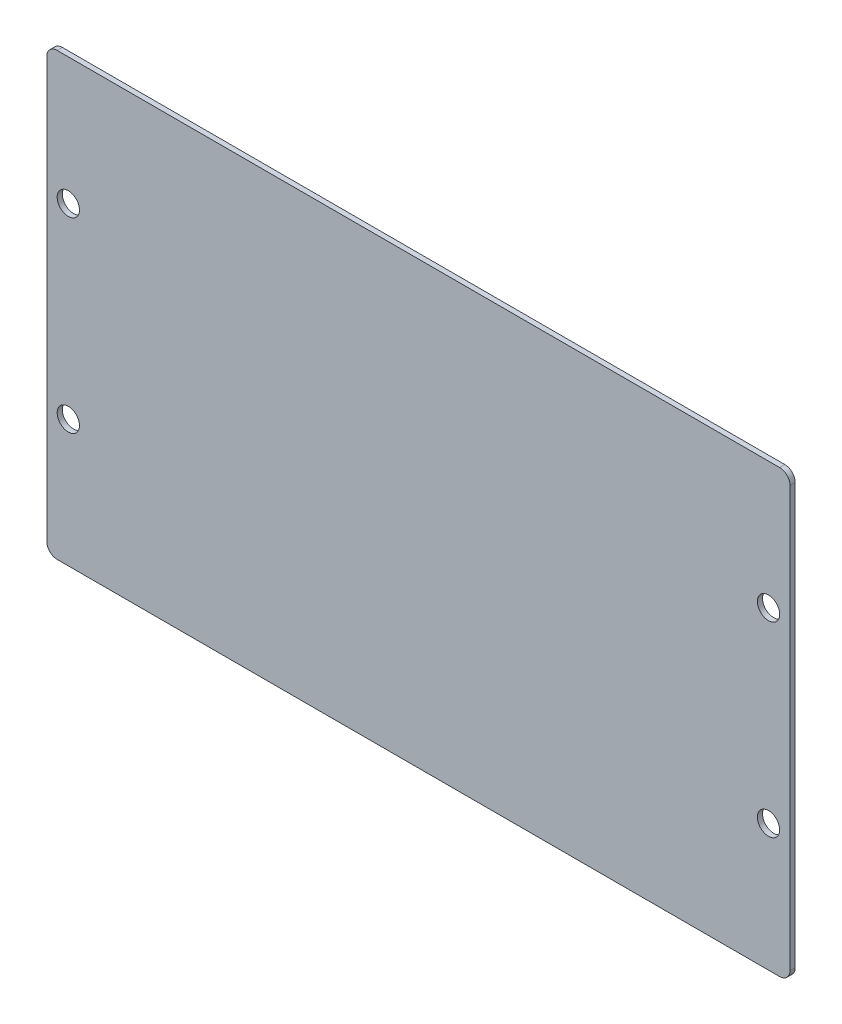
ISO-10303-21;
HEADER;
FILE_DESCRIPTION(('STEP AP214'),'2;1');
FILE_NAME('part.step','',(''),(''),'','','');
FILE_SCHEMA(('AUTOMOTIVE_DESIGN { 1 0 10303 214 1 1 1 1 }'));
ENDSEC;
DATA;
#1=APPLICATION_CONTEXT('core data for automotive mechanical design processes');
#2=APPLICATION_PROTOCOL_DEFINITION('international standard','automotive_design',2000,#1);
#3=PRODUCT_CONTEXT('',#1,'mechanical');
#4=PRODUCT('Part','Part','',(#3));
#5=PRODUCT_RELATED_PRODUCT_CATEGORY('part','',(#4));
#6=PRODUCT_DEFINITION_FORMATION('','',#4);
#7=PRODUCT_DEFINITION_CONTEXT('part definition',#1,'design');
#8=PRODUCT_DEFINITION('design','',#6,#7);
#9=PRODUCT_DEFINITION_SHAPE('','',#8);
#10=(LENGTH_UNIT() NAMED_UNIT(*) SI_UNIT(.MILLI.,.METRE.));
#11=(NAMED_UNIT(*) PLANE_ANGLE_UNIT() SI_UNIT($,.RADIAN.));
#12=(NAMED_UNIT(*) SI_UNIT($,.STERADIAN.) SOLID_ANGLE_UNIT());
#13=UNCERTAINTY_MEASURE_WITH_UNIT(LENGTH_MEASURE(1.E-05),#10,'distance_accuracy_value','');
#14=(GEOMETRIC_REPRESENTATION_CONTEXT(3) GLOBAL_UNCERTAINTY_ASSIGNED_CONTEXT((#13)) GLOBAL_UNIT_ASSIGNED_CONTEXT((#10,
#11,#12)) REPRESENTATION_CONTEXT('',''));
#15=CARTESIAN_POINT('',(0.,0.,0.));
#16=DIRECTION('',(0.,0.,1.));
#17=DIRECTION('',(1.,0.,0.));
#18=AXIS2_PLACEMENT_3D('',#15,#16,#17);
#19=CARTESIAN_POINT('',(71.65,42.5,1.));
#20=DIRECTION('',(0.,0.,1.));
#21=DIRECTION('',(0.,-1.,0.));
#22=AXIS2_PLACEMENT_3D('',#19,#20,#21);
#23=PLANE('',#22);
#24=CARTESIAN_POINT('',(-67.5,-18.,1.00000000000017));
#25=DIRECTION('',(0.,0.,-1.));
#26=DIRECTION('',(0.,1.,0.));
#27=AXIS2_PLACEMENT_3D('',#24,#25,#26);
#28=CIRCLE('',#27,2.15);
#29=CARTESIAN_POINT('',(-67.5,-15.85,1.00000000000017));
#30=VERTEX_POINT('',#29);
#31=EDGE_CURVE('E142',#30,#30,#28,.T.);
#32=ORIENTED_EDGE('',*,*,#31,.T.);
#33=EDGE_LOOP('',(#32));
#34=FACE_BOUND('',#33,.T.);
#35=CARTESIAN_POINT('',(67.5,18.,1.));
#36=DIRECTION('',(0.,0.,-1.));
#37=DIRECTION('',(0.,1.,0.));
#38=AXIS2_PLACEMENT_3D('',#35,#36,#37);
#39=CIRCLE('',#38,2.15);
#40=CARTESIAN_POINT('',(67.5,20.15,1.));
#41=VERTEX_POINT('',#40);
#42=EDGE_CURVE('E110',#41,#41,#39,.T.);
#43=ORIENTED_EDGE('',*,*,#42,.T.);
#44=EDGE_LOOP('',(#43));
#45=FACE_BOUND('',#44,.T.);
#46=DIRECTION('',(1.,0.,0.));
#47=VECTOR('',#46,1.);
#48=CARTESIAN_POINT('',(71.65,42.5,1.));
#49=LINE('',#48,#47);
#50=CARTESIAN_POINT('',(69.65,42.5,1.));
#51=VERTEX_POINT('',#50);
#52=CARTESIAN_POINT('',(-69.65,42.5,1.00000000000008));
#53=VERTEX_POINT('',#52);
#54=EDGE_CURVE('E116',#51,#53,#49,.F.);
#55=ORIENTED_EDGE('',*,*,#54,.T.);
#56=CARTESIAN_POINT('',(-69.65,40.5,1.00000000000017));
#57=DIRECTION('',(0.,0.,-1.));
#58=DIRECTION('',(0.,1.,0.));
#59=AXIS2_PLACEMENT_3D('',#56,#57,#58);
#60=CIRCLE('',#59,2.);
#61=CARTESIAN_POINT('',(-71.65,40.5,1.00000000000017));
#62=VERTEX_POINT('',#61);
#63=EDGE_CURVE('E117',#62,#53,#60,.T.);
#64=ORIENTED_EDGE('',*,*,#63,.F.);
#65=DIRECTION('',(0.,1.,0.));
#66=VECTOR('',#65,1.);
#67=CARTESIAN_POINT('',(-71.65,-42.5,1.00000000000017));
#68=LINE('',#67,#66);
#69=CARTESIAN_POINT('',(-71.65,-40.5,1.00000000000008));
#70=VERTEX_POINT('',#69);
#71=EDGE_CURVE('E111',#62,#70,#68,.F.);
#72=ORIENTED_EDGE('',*,*,#71,.T.);
#73=CARTESIAN_POINT('',(-69.65,-40.5,1.));
#74=DIRECTION('',(0.,0.,-1.));
#75=DIRECTION('',(0.,1.,0.));
#76=AXIS2_PLACEMENT_3D('',#73,#74,#75);
#77=CIRCLE('',#76,2.);
#78=CARTESIAN_POINT('',(-69.65,-42.5,1.));
#79=VERTEX_POINT('',#78);
#80=EDGE_CURVE('E114',#79,#70,#77,.T.);
#81=ORIENTED_EDGE('',*,*,#80,.F.);
#82=DIRECTION('',(-1.,0.,0.));
#83=VECTOR('',#82,1.);
#84=CARTESIAN_POINT('',(71.65,-42.5,1.));
#85=LINE('',#84,#83);
#86=CARTESIAN_POINT('',(69.65,-42.5,1.));
#87=VERTEX_POINT('',#86);
#88=EDGE_CURVE('E87',#79,#87,#85,.F.);
#89=ORIENTED_EDGE('',*,*,#88,.T.);
#90=CARTESIAN_POINT('',(69.65,-40.5,1.));
#91=DIRECTION('',(0.,0.,-1.));
#92=DIRECTION('',(0.,1.,0.));
#93=AXIS2_PLACEMENT_3D('',#90,#91,#92);
#94=CIRCLE('',#93,2.);
#95=CARTESIAN_POINT('',(71.65,-40.5,1.));
#96=VERTEX_POINT('',#95);
#97=EDGE_CURVE('E81',#96,#87,#94,.T.);
#98=ORIENTED_EDGE('',*,*,#97,.F.);
#99=DIRECTION('',(0.,-1.,0.));
#100=VECTOR('',#99,1.);
#101=CARTESIAN_POINT('',(71.65,-42.5,1.));
#102=LINE('',#101,#100);
#103=CARTESIAN_POINT('',(71.65,40.5,1.));
#104=VERTEX_POINT('',#103);
#105=EDGE_CURVE('E85',#96,#104,#102,.F.);
#106=ORIENTED_EDGE('',*,*,#105,.T.);
#107=CARTESIAN_POINT('',(69.65,40.5,1.));
#108=DIRECTION('',(0.,0.,-1.));
#109=DIRECTION('',(0.,1.,0.));
#110=AXIS2_PLACEMENT_3D('',#107,#108,#109);
#111=CIRCLE('',#110,2.);
#112=EDGE_CURVE('E100',#51,#104,#111,.T.);
#113=ORIENTED_EDGE('',*,*,#112,.F.);
#114=EDGE_LOOP('',(#55,#64,#72,#81,#89,#98,#106,#113));
#115=FACE_BOUND('',#114,.T.);
#116=CARTESIAN_POINT('',(67.5,-18.,1.));
#117=DIRECTION('',(0.,0.,-1.));
#118=DIRECTION('',(0.,1.,0.));
#119=AXIS2_PLACEMENT_3D('',#116,#117,#118);
#120=CIRCLE('',#119,2.15);
#121=CARTESIAN_POINT('',(67.5,-15.85,1.));
#122=VERTEX_POINT('',#121);
#123=EDGE_CURVE('E93',#122,#122,#120,.T.);
#124=ORIENTED_EDGE('',*,*,#123,.T.);
#125=EDGE_LOOP('',(#124));
#126=FACE_BOUND('',#125,.T.);
#127=CARTESIAN_POINT('',(-67.5,18.,1.00000000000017));
#128=DIRECTION('',(0.,0.,-1.));
#129=DIRECTION('',(0.,1.,0.));
#130=AXIS2_PLACEMENT_3D('',#127,#128,#129);
#131=CIRCLE('',#130,2.15);
#132=CARTESIAN_POINT('',(-67.5,20.15,1.00000000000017));
#133=VERTEX_POINT('',#132);
#134=EDGE_CURVE('E20',#133,#133,#131,.T.);
#135=ORIENTED_EDGE('',*,*,#134,.T.);
#136=EDGE_LOOP('',(#135));
#137=FACE_BOUND('',#136,.T.);
#138=ADVANCED_FACE('F17',(#34,#45,#115,#126,#137),#23,.T.);
#139=CARTESIAN_POINT('',(-67.5,18.,1.00000000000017));
#140=DIRECTION('',(0.,0.,-1.));
#141=DIRECTION('',(0.,1.,0.));
#142=AXIS2_PLACEMENT_3D('',#139,#140,#141);
#143=CYLINDRICAL_SURFACE('',#142,2.15);
#144=CARTESIAN_POINT('',(-67.5,18.,1.66533453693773E-13));
#145=DIRECTION('',(0.,0.,-1.));
#146=DIRECTION('',(0.,1.,0.));
#147=AXIS2_PLACEMENT_3D('',#144,#145,#146);
#148=CIRCLE('',#147,2.15);
#149=CARTESIAN_POINT('',(-67.5,20.15,1.66533453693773E-13));
#150=VERTEX_POINT('',#149);
#151=EDGE_CURVE('E139',#150,#150,#148,.T.);
#152=ORIENTED_EDGE('',*,*,#151,.T.);
#153=EDGE_LOOP('',(#152));
#154=FACE_BOUND('',#153,.T.);
#155=ORIENTED_EDGE('',*,*,#134,.F.);
#156=EDGE_LOOP('',(#155));
#157=FACE_BOUND('',#156,.T.);
#158=ADVANCED_FACE('F157',(#154,#157),#143,.F.);
#159=CARTESIAN_POINT('',(67.5,-18.,1.));
#160=DIRECTION('',(0.,0.,-1.));
#161=DIRECTION('',(0.,1.,0.));
#162=AXIS2_PLACEMENT_3D('',#159,#160,#161);
#163=CYLINDRICAL_SURFACE('',#162,2.15);
#164=CARTESIAN_POINT('',(67.5,-18.,0.));
#165=DIRECTION('',(0.,0.,-1.));
#166=DIRECTION('',(0.,1.,0.));
#167=AXIS2_PLACEMENT_3D('',#164,#165,#166);
#168=CIRCLE('',#167,2.15);
#169=CARTESIAN_POINT('',(67.5,-15.85,0.));
#170=VERTEX_POINT('',#169);
#171=EDGE_CURVE('E136',#170,#170,#168,.T.);
#172=ORIENTED_EDGE('',*,*,#171,.T.);
#173=EDGE_LOOP('',(#172));
#174=FACE_BOUND('',#173,.T.);
#175=ORIENTED_EDGE('',*,*,#123,.F.);
#176=EDGE_LOOP('',(#175));
#177=FACE_BOUND('',#176,.T.);
#178=ADVANCED_FACE('F159',(#174,#177),#163,.F.);
#179=CARTESIAN_POINT('',(69.65,-40.5,1.));
#180=DIRECTION('',(0.,0.,-1.));
#181=DIRECTION('',(0.,1.,0.));
#182=AXIS2_PLACEMENT_3D('',#179,#180,#181);
#183=CYLINDRICAL_SURFACE('',#182,2.);
#184=CARTESIAN_POINT('',(69.65,-40.5,0.));
#185=DIRECTION('',(0.,0.,-1.));
#186=DIRECTION('',(0.,1.,0.));
#187=AXIS2_PLACEMENT_3D('',#184,#185,#186);
#188=CIRCLE('',#187,2.);
#189=CARTESIAN_POINT('',(69.65,-42.5,0.));
#190=VERTEX_POINT('',#189);
#191=CARTESIAN_POINT('',(71.65,-40.5,0.));
#192=VERTEX_POINT('',#191);
#193=EDGE_CURVE('E104',#190,#192,#188,.F.);
#194=ORIENTED_EDGE('',*,*,#193,.T.);
#195=DIRECTION('',(0.,0.,1.));
#196=VECTOR('',#195,1.);
#197=CARTESIAN_POINT('',(71.65,-40.5,1.));
#198=LINE('',#197,#196);
#199=EDGE_CURVE('E92',#192,#96,#198,.T.);
#200=ORIENTED_EDGE('',*,*,#199,.T.);
#201=ORIENTED_EDGE('',*,*,#97,.T.);
#202=DIRECTION('',(0.,0.,1.));
#203=VECTOR('',#202,1.);
#204=CARTESIAN_POINT('',(69.65,-42.5,1.));
#205=LINE('',#204,#203);
#206=EDGE_CURVE('E312',#87,#190,#205,.F.);
#207=ORIENTED_EDGE('',*,*,#206,.T.);
#208=EDGE_LOOP('',(#194,#200,#201,#207));
#209=FACE_BOUND('',#208,.T.);
#210=ADVANCED_FACE('F103',(#209),#183,.T.);
#211=CARTESIAN_POINT('',(71.65,-42.5,1.));
#212=DIRECTION('',(-1.,0.,0.));
#213=DIRECTION('',(0.,-1.,0.));
#214=AXIS2_PLACEMENT_3D('',#211,#212,#213);
#215=PLANE('',#214);
#216=ORIENTED_EDGE('',*,*,#199,.F.);
#217=DIRECTION('',(0.,-1.,0.));
#218=VECTOR('',#217,1.);
#219=CARTESIAN_POINT('',(71.65,42.5,0.));
#220=LINE('',#219,#218);
#221=CARTESIAN_POINT('',(71.65,40.5,0.));
#222=VERTEX_POINT('',#221);
#223=EDGE_CURVE('E134',#192,#222,#220,.F.);
#224=ORIENTED_EDGE('',*,*,#223,.T.);
#225=DIRECTION('',(0.,0.,-1.));
#226=VECTOR('',#225,1.);
#227=CARTESIAN_POINT('',(71.65,40.5,1.));
#228=LINE('',#227,#226);
#229=EDGE_CURVE('E99',#104,#222,#228,.T.);
#230=ORIENTED_EDGE('',*,*,#229,.F.);
#231=ORIENTED_EDGE('',*,*,#105,.F.);
#232=EDGE_LOOP('',(#216,#224,#230,#231));
#233=FACE_BOUND('',#232,.T.);
#234=ADVANCED_FACE('F96',(#233),#215,.F.);
#235=CARTESIAN_POINT('',(69.65,40.5,1.));
#236=DIRECTION('',(0.,0.,-1.));
#237=DIRECTION('',(0.,1.,0.));
#238=AXIS2_PLACEMENT_3D('',#235,#236,#237);
#239=CYLINDRICAL_SURFACE('',#238,2.);
#240=CARTESIAN_POINT('',(69.65,40.5,0.));
#241=DIRECTION('',(0.,0.,-1.));
#242=DIRECTION('',(0.,1.,0.));
#243=AXIS2_PLACEMENT_3D('',#240,#241,#242);
#244=CIRCLE('',#243,2.);
#245=CARTESIAN_POINT('',(69.65,42.5,0.));
#246=VERTEX_POINT('',#245);
#247=EDGE_CURVE('E131',#222,#246,#244,.F.);
#248=ORIENTED_EDGE('',*,*,#247,.T.);
#249=DIRECTION('',(0.,0.,1.));
#250=VECTOR('',#249,1.);
#251=CARTESIAN_POINT('',(69.65,42.5,1.));
#252=LINE('',#251,#250);
#253=EDGE_CURVE('E118',#246,#51,#252,.T.);
#254=ORIENTED_EDGE('',*,*,#253,.T.);
#255=ORIENTED_EDGE('',*,*,#112,.T.);
#256=ORIENTED_EDGE('',*,*,#229,.T.);
#257=EDGE_LOOP('',(#248,#254,#255,#256));
#258=FACE_BOUND('',#257,.T.);
#259=ADVANCED_FACE('F204',(#258),#239,.T.);
#260=CARTESIAN_POINT('',(71.65,42.5,1.));
#261=DIRECTION('',(0.,-1.,0.));
#262=DIRECTION('',(1.,0.,0.));
#263=AXIS2_PLACEMENT_3D('',#260,#261,#262);
#264=PLANE('',#263);
#265=DIRECTION('',(0.,0.,-1.));
#266=VECTOR('',#265,1.);
#267=CARTESIAN_POINT('',(-69.65,42.5,1.00000000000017));
#268=LINE('',#267,#266);
#269=CARTESIAN_POINT('',(-69.65,42.5,0.));
#270=VERTEX_POINT('',#269);
#271=EDGE_CURVE('E150',#53,#270,#268,.T.);
#272=ORIENTED_EDGE('',*,*,#271,.F.);
#273=ORIENTED_EDGE('',*,*,#54,.F.);
#274=ORIENTED_EDGE('',*,*,#253,.F.);
#275=DIRECTION('',(1.,0.,0.));
#276=VECTOR('',#275,1.);
#277=CARTESIAN_POINT('',(71.65,42.5,0.));
#278=LINE('',#277,#276);
#279=EDGE_CURVE('E130',#246,#270,#278,.F.);
#280=ORIENTED_EDGE('',*,*,#279,.T.);
#281=EDGE_LOOP('',(#272,#273,#274,#280));
#282=FACE_BOUND('',#281,.T.);
#283=ADVANCED_FACE('F200',(#282),#264,.F.);
#284=CARTESIAN_POINT('',(-69.65,40.5,1.00000000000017));
#285=DIRECTION('',(0.,0.,-1.));
#286=DIRECTION('',(0.,1.,0.));
#287=AXIS2_PLACEMENT_3D('',#284,#285,#286);
#288=CYLINDRICAL_SURFACE('',#287,2.);
#289=CARTESIAN_POINT('',(-69.65,40.5,1.66533453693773E-13));
#290=DIRECTION('',(0.,0.,-1.));
#291=DIRECTION('',(0.,1.,0.));
#292=AXIS2_PLACEMENT_3D('',#289,#290,#291);
#293=CIRCLE('',#292,2.);
#294=CARTESIAN_POINT('',(-71.65,40.5,0.));
#295=VERTEX_POINT('',#294);
#296=EDGE_CURVE('E127',#270,#295,#293,.F.);
#297=ORIENTED_EDGE('',*,*,#296,.T.);
#298=DIRECTION('',(0.,0.,1.));
#299=VECTOR('',#298,1.);
#300=CARTESIAN_POINT('',(-71.65,40.5,1.));
#301=LINE('',#300,#299);
#302=EDGE_CURVE('E115',#295,#62,#301,.T.);
#303=ORIENTED_EDGE('',*,*,#302,.T.);
#304=ORIENTED_EDGE('',*,*,#63,.T.);
#305=ORIENTED_EDGE('',*,*,#271,.T.);
#306=EDGE_LOOP('',(#297,#303,#304,#305));
#307=FACE_BOUND('',#306,.T.);
#308=ADVANCED_FACE('F196',(#307),#288,.T.);
#309=CARTESIAN_POINT('',(-71.65,-42.5,1.));
#310=DIRECTION('',(1.,0.,0.));
#311=DIRECTION('',(0.,1.,0.));
#312=AXIS2_PLACEMENT_3D('',#309,#310,#311);
#313=PLANE('',#312);
#314=DIRECTION('',(0.,0.,-1.));
#315=VECTOR('',#314,1.);
#316=CARTESIAN_POINT('',(-71.65,-40.5,1.));
#317=LINE('',#316,#315);
#318=CARTESIAN_POINT('',(-71.65,-40.5,0.));
#319=VERTEX_POINT('',#318);
#320=EDGE_CURVE('E148',#70,#319,#317,.T.);
#321=ORIENTED_EDGE('',*,*,#320,.F.);
#322=ORIENTED_EDGE('',*,*,#71,.F.);
#323=ORIENTED_EDGE('',*,*,#302,.F.);
#324=DIRECTION('',(0.,-1.,0.));
#325=VECTOR('',#324,1.);
#326=CARTESIAN_POINT('',(-71.65,42.5,0.));
#327=LINE('',#326,#325);
#328=EDGE_CURVE('E126',#295,#319,#327,.T.);
#329=ORIENTED_EDGE('',*,*,#328,.T.);
#330=EDGE_LOOP('',(#321,#322,#323,#329));
#331=FACE_BOUND('',#330,.T.);
#332=ADVANCED_FACE('F192',(#331),#313,.F.);
#333=CARTESIAN_POINT('',(-69.65,-40.5,1.));
#334=DIRECTION('',(0.,0.,-1.));
#335=DIRECTION('',(0.,1.,0.));
#336=AXIS2_PLACEMENT_3D('',#333,#334,#335);
#337=CYLINDRICAL_SURFACE('',#336,2.);
#338=CARTESIAN_POINT('',(-69.65,-40.5,0.));
#339=DIRECTION('',(0.,0.,-1.));
#340=DIRECTION('',(0.,1.,0.));
#341=AXIS2_PLACEMENT_3D('',#338,#339,#340);
#342=CIRCLE('',#341,2.);
#343=CARTESIAN_POINT('',(-69.65,-42.5,0.));
#344=VERTEX_POINT('',#343);
#345=EDGE_CURVE('E123',#319,#344,#342,.F.);
#346=ORIENTED_EDGE('',*,*,#345,.T.);
#347=DIRECTION('',(0.,0.,1.));
#348=VECTOR('',#347,1.);
#349=CARTESIAN_POINT('',(-69.65,-42.5,1.));
#350=LINE('',#349,#348);
#351=EDGE_CURVE('E35',#344,#79,#350,.T.);
#352=ORIENTED_EDGE('',*,*,#351,.T.);
#353=ORIENTED_EDGE('',*,*,#80,.T.);
#354=ORIENTED_EDGE('',*,*,#320,.T.);
#355=EDGE_LOOP('',(#346,#352,#353,#354));
#356=FACE_BOUND('',#355,.T.);
#357=ADVANCED_FACE('F189',(#356),#337,.T.);
#358=CARTESIAN_POINT('',(71.65,-42.5,1.));
#359=DIRECTION('',(0.,1.,0.));
#360=DIRECTION('',(-1.,0.,0.));
#361=AXIS2_PLACEMENT_3D('',#358,#359,#360);
#362=PLANE('',#361);
#363=ORIENTED_EDGE('',*,*,#351,.F.);
#364=DIRECTION('',(1.,0.,0.));
#365=VECTOR('',#364,1.);
#366=CARTESIAN_POINT('',(71.65,-42.5,0.));
#367=LINE('',#366,#365);
#368=EDGE_CURVE('E122',#344,#190,#367,.T.);
#369=ORIENTED_EDGE('',*,*,#368,.T.);
#370=ORIENTED_EDGE('',*,*,#206,.F.);
#371=ORIENTED_EDGE('',*,*,#88,.F.);
#372=EDGE_LOOP('',(#363,#369,#370,#371));
#373=FACE_BOUND('',#372,.T.);
#374=ADVANCED_FACE('F185',(#373),#362,.F.);
#375=CARTESIAN_POINT('',(67.5,18.,1.));
#376=DIRECTION('',(0.,0.,-1.));
#377=DIRECTION('',(0.,1.,0.));
#378=AXIS2_PLACEMENT_3D('',#375,#376,#377);
#379=CYLINDRICAL_SURFACE('',#378,2.15);
#380=CARTESIAN_POINT('',(67.5,18.,0.));
#381=DIRECTION('',(0.,0.,-1.));
#382=DIRECTION('',(0.,1.,0.));
#383=AXIS2_PLACEMENT_3D('',#380,#381,#382);
#384=CIRCLE('',#383,2.15);
#385=CARTESIAN_POINT('',(67.5,20.15,0.));
#386=VERTEX_POINT('',#385);
#387=EDGE_CURVE('E26',#386,#386,#384,.T.);
#388=ORIENTED_EDGE('',*,*,#387,.T.);
#389=EDGE_LOOP('',(#388));
#390=FACE_BOUND('',#389,.T.);
#391=ORIENTED_EDGE('',*,*,#42,.F.);
#392=EDGE_LOOP('',(#391));
#393=FACE_BOUND('',#392,.T.);
#394=ADVANCED_FACE('F177',(#390,#393),#379,.F.);
#395=CARTESIAN_POINT('',(-67.5,-18.,1.00000000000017));
#396=DIRECTION('',(0.,0.,-1.));
#397=DIRECTION('',(0.,1.,0.));
#398=AXIS2_PLACEMENT_3D('',#395,#396,#397);
#399=CYLINDRICAL_SURFACE('',#398,2.15);
#400=CARTESIAN_POINT('',(-67.5,-18.,1.66533453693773E-13));
#401=DIRECTION('',(0.,0.,-1.));
#402=DIRECTION('',(0.,1.,0.));
#403=AXIS2_PLACEMENT_3D('',#400,#401,#402);
#404=CIRCLE('',#403,2.15);
#405=CARTESIAN_POINT('',(-67.5,-15.85,1.66533453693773E-13));
#406=VERTEX_POINT('',#405);
#407=EDGE_CURVE('E11',#406,#406,#404,.T.);
#408=ORIENTED_EDGE('',*,*,#407,.T.);
#409=EDGE_LOOP('',(#408));
#410=FACE_BOUND('',#409,.T.);
#411=ORIENTED_EDGE('',*,*,#31,.F.);
#412=EDGE_LOOP('',(#411));
#413=FACE_BOUND('',#412,.T.);
#414=ADVANCED_FACE('F171',(#410,#413),#399,.F.);
#415=CARTESIAN_POINT('',(71.65,42.5,0.));
#416=DIRECTION('',(0.,0.,1.));
#417=DIRECTION('',(0.,-1.,0.));
#418=AXIS2_PLACEMENT_3D('',#415,#416,#417);
#419=PLANE('',#418);
#420=ORIENTED_EDGE('',*,*,#407,.F.);
#421=EDGE_LOOP('',(#420));
#422=FACE_BOUND('',#421,.T.);
#423=ORIENTED_EDGE('',*,*,#387,.F.);
#424=EDGE_LOOP('',(#423));
#425=FACE_BOUND('',#424,.T.);
#426=ORIENTED_EDGE('',*,*,#345,.F.);
#427=ORIENTED_EDGE('',*,*,#328,.F.);
#428=ORIENTED_EDGE('',*,*,#296,.F.);
#429=ORIENTED_EDGE('',*,*,#279,.F.);
#430=ORIENTED_EDGE('',*,*,#247,.F.);
#431=ORIENTED_EDGE('',*,*,#223,.F.);
#432=ORIENTED_EDGE('',*,*,#193,.F.);
#433=ORIENTED_EDGE('',*,*,#368,.F.);
#434=EDGE_LOOP('',(#426,#427,#428,#429,#430,#431,#432,#433));
#435=FACE_BOUND('',#434,.T.);
#436=ORIENTED_EDGE('',*,*,#171,.F.);
#437=EDGE_LOOP('',(#436));
#438=FACE_BOUND('',#437,.T.);
#439=ORIENTED_EDGE('',*,*,#151,.F.);
#440=EDGE_LOOP('',(#439));
#441=FACE_BOUND('',#440,.T.);
#442=ADVANCED_FACE('F169',(#422,#425,#435,#438,#441),#419,.F.);
#443=CLOSED_SHELL('',(#138,#158,#178,#210,#234,#259,#283,#308,#332,#357,#374,#394,#414,#442));
#444=MANIFOLD_SOLID_BREP('B1',#443);
#445=ADVANCED_BREP_SHAPE_REPRESENTATION('',(#18,#444),#14);
#446=SHAPE_DEFINITION_REPRESENTATION(#9,#445);
ENDSEC;
END-ISO-10303-21;
